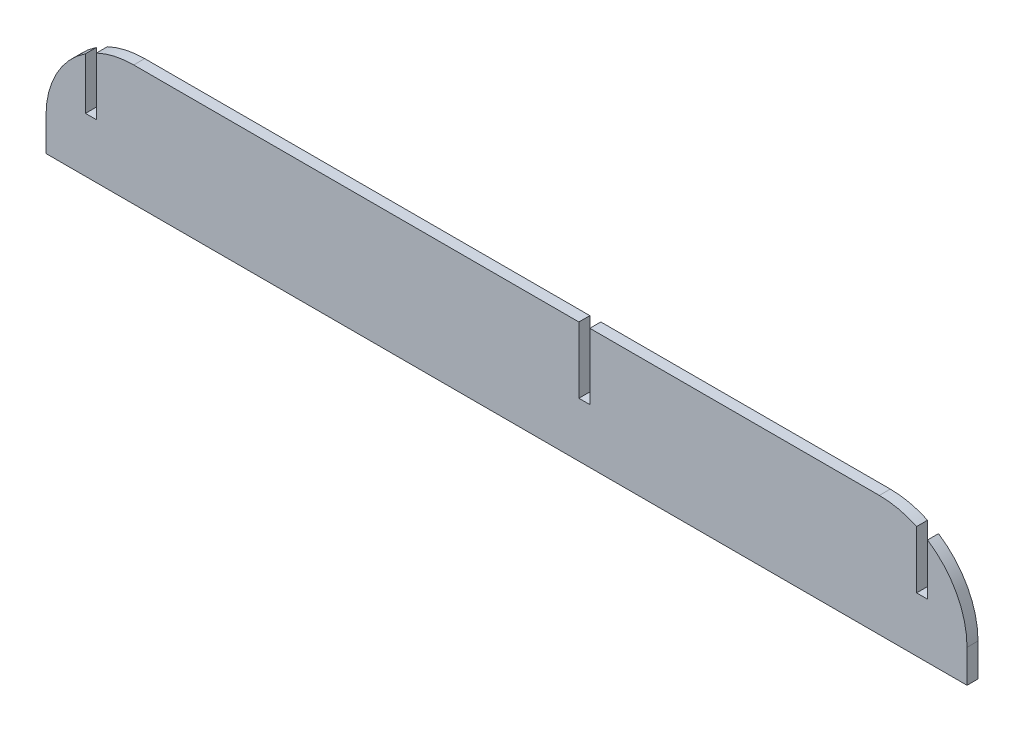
from build123d import *

# Parameters (mm, degrees)
CROQUIS1_W              = 420
CROQUIS1_H              = 55
SALIENTE_EXTRUIR1_DEPTH = 5
REDONDEO1_R             = 40
CROQUIS2_W              = 5
CROQUIS2_H              = 30.136381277
CORTAR_EXTRUIR1_DEPTH   = 218.140507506


with BuildPart() as part:
    # Croquis1 → Saliente-Extruir1 (new body)
    with BuildSketch(Plane.XY):
        with Locations((0, 27.5)):
            Rectangle(CROQUIS1_W, CROQUIS1_H)
    extrude(amount=SALIENTE_EXTRUIR1_DEPTH)

    # Redondeo1
    redondeo1_edges = [part.edges().sort_by_distance(p)[0] for p in [
        (-210, 55, 2.5),
        (210, 55, 2.5),
    ]]
    fillet(redondeo1_edges, radius=REDONDEO1_R)

    # Croquis2 → Cortar-Extruir1 (cut, through all)
    with BuildSketch(Plane(origin=(0, 0, 0), x_dir=(-1, 0, 0), z_dir=(0, 0, -1))):
        with BuildLine():
            Line((-187, 25), (-187, 51.20773398))
            ThreePointArc((-187, 51.20773398), (-189.550232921, 49.896824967), (-192, 48.406586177))
            Line((-192, 48.406586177), (-192, 25))
            Line((-192, 25), (-187, 25))
        make_face()
        with BuildLine():
            ThreePointArc((-192, 48.406586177), (-189.550232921, 49.896824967), (-187, 51.20773398))
            Line((-187, 51.20773398), (-187, 55))
            Line((-187, 55), (-192, 55))
            Line((-192, 55), (-192, 48.406586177))
        make_face()
        with Locations((-35.5, 39.931809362)):
            Rectangle(CROQUIS2_W, CROQUIS2_H)
        with BuildLine():
            Line((187, 55), (187, 51.20773398))
            ThreePointArc((187, 51.20773398), (189.550232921, 49.896824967), (192, 48.406586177))
            Line((192, 48.406586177), (192, 55))
            Line((192, 55), (187, 55))
        make_face()
        with BuildLine():
            ThreePointArc((192, 48.406586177), (189.550232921, 49.896824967), (187, 51.20773398))
            Line((187, 51.20773398), (187, 24.863618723))
            Line((187, 24.863618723), (192, 24.863618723))
            Line((192, 24.863618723), (192, 48.406586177))
        make_face()
    extrude(amount=-CORTAR_EXTRUIR1_DEPTH, mode=Mode.SUBTRACT)


solid = part.part
